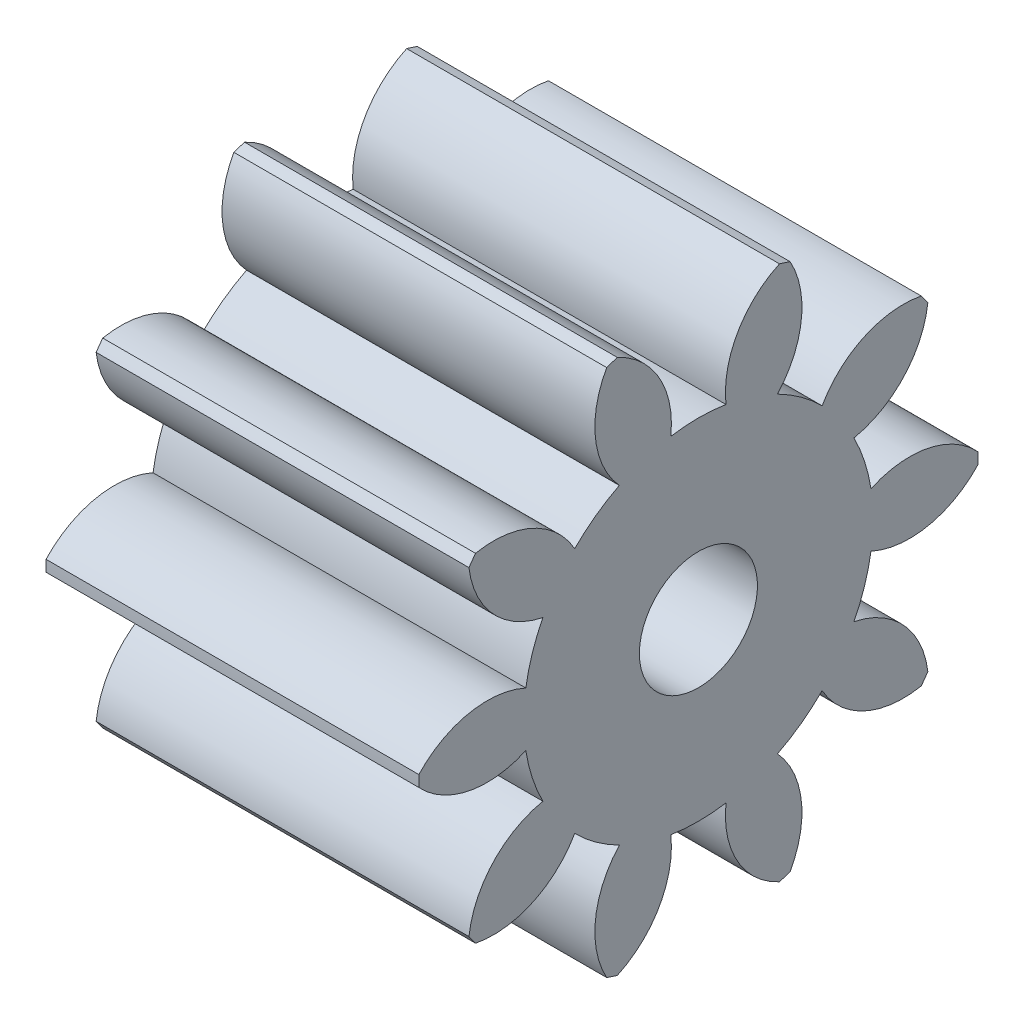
ISO-10303-21;
HEADER;
FILE_DESCRIPTION(('STEP AP214'),'2;1');
FILE_NAME('part.step','',(''),(''),'','','');
FILE_SCHEMA(('AUTOMOTIVE_DESIGN { 1 0 10303 214 1 1 1 1 }'));
ENDSEC;
DATA;
#1=APPLICATION_CONTEXT('core data for automotive mechanical design processes');
#2=APPLICATION_PROTOCOL_DEFINITION('international standard','automotive_design',2000,#1);
#3=PRODUCT_CONTEXT('',#1,'mechanical');
#4=PRODUCT('Part','Part','',(#3));
#5=PRODUCT_RELATED_PRODUCT_CATEGORY('part','',(#4));
#6=PRODUCT_DEFINITION_FORMATION('','',#4);
#7=PRODUCT_DEFINITION_CONTEXT('part definition',#1,'design');
#8=PRODUCT_DEFINITION('design','',#6,#7);
#9=PRODUCT_DEFINITION_SHAPE('','',#8);
#10=(LENGTH_UNIT() NAMED_UNIT(*) SI_UNIT(.MILLI.,.METRE.));
#11=(NAMED_UNIT(*) PLANE_ANGLE_UNIT() SI_UNIT($,.RADIAN.));
#12=(NAMED_UNIT(*) SI_UNIT($,.STERADIAN.) SOLID_ANGLE_UNIT());
#13=UNCERTAINTY_MEASURE_WITH_UNIT(LENGTH_MEASURE(1.E-05),#10,'distance_accuracy_value','');
#14=(GEOMETRIC_REPRESENTATION_CONTEXT(3) GLOBAL_UNCERTAINTY_ASSIGNED_CONTEXT((#13)) GLOBAL_UNIT_ASSIGNED_CONTEXT((#10,
#11,#12)) REPRESENTATION_CONTEXT('',''));
#15=CARTESIAN_POINT('',(0.,0.,0.));
#16=DIRECTION('',(0.,0.,1.));
#17=DIRECTION('',(1.,0.,0.));
#18=AXIS2_PLACEMENT_3D('',#15,#16,#17);
#19=CARTESIAN_POINT('',(-0.0287284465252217,1.05062918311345,0.));
#20=DIRECTION('',(-1.,0.,0.));
#21=DIRECTION('',(0.,0.,1.));
#22=AXIS2_PLACEMENT_3D('',#19,#20,#21);
#23=PLANE('',#22);
#24=CARTESIAN_POINT('',(-0.0287284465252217,1.05062918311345,0.));
#25=DIRECTION('',(-1.,0.,0.));
#26=DIRECTION('',(0.,0.,1.));
#27=AXIS2_PLACEMENT_3D('',#24,#25,#26);
#28=CIRCLE('',#27,0.95);
#29=CARTESIAN_POINT('',(-0.0287284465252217,1.05062918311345,0.95));
#30=VERTEX_POINT('',#29);
#31=EDGE_CURVE('E742',#30,#30,#28,.T.);
#32=ORIENTED_EDGE('',*,*,#31,.T.);
#33=EDGE_LOOP('',(#32));
#34=FACE_BOUND('',#33,.T.);
#35=CARTESIAN_POINT('',(-0.0287284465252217,0.121111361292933,-3.39904348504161));
#36=DIRECTION('',(-1.,0.,0.));
#37=DIRECTION('',(0.,-0.95105651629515,-0.309016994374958));
#38=AXIS2_PLACEMENT_3D('',#35,#36,#37);
#39=CIRCLE('',#38,1.5);
#40=CARTESIAN_POINT('',(-0.0287284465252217,1.48629734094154,-2.77753946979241));
#41=VERTEX_POINT('',#40);
#42=CARTESIAN_POINT('',(-0.0287284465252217,1.14085937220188,-4.49909529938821));
#43=VERTEX_POINT('',#42);
#44=EDGE_CURVE('E356',#41,#43,#39,.T.);
#45=ORIENTED_EDGE('',*,*,#44,.F.);
#46=CARTESIAN_POINT('',(-0.0287284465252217,1.05062918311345,0.));
#47=DIRECTION('',(-1.,0.,0.));
#48=DIRECTION('',(0.,-0.95105651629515,-0.309016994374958));
#49=AXIS2_PLACEMENT_3D('',#46,#47,#48);
#50=CIRCLE('',#49,2.8115);
#51=CARTESIAN_POINT('',(-0.0287284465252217,2.33076297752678,-2.50315595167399));
#52=VERTEX_POINT('',#51);
#53=EDGE_CURVE('E361',#52,#41,#50,.T.);
#54=ORIENTED_EDGE('',*,*,#53,.F.);
#55=CARTESIAN_POINT('',(-0.0287284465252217,3.80053252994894,-2.20352707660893));
#56=DIRECTION('',(-1.,0.,0.));
#57=DIRECTION('',(0.,-0.95105651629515,-0.309016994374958));
#58=AXIS2_PLACEMENT_3D('',#55,#56,#57);
#59=CIRCLE('',#58,1.5);
#60=CARTESIAN_POINT('',(-0.0287284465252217,3.6221332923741,-3.69288053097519));
#61=VERTEX_POINT('',#60);
#62=EDGE_CURVE('E358',#61,#52,#59,.T.);
#63=ORIENTED_EDGE('',*,*,#62,.F.);
#64=CARTESIAN_POINT('',(-0.0287284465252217,1.05062918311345,0.));
#65=DIRECTION('',(-1.,0.,0.));
#66=DIRECTION('',(0.,0.,1.));
#67=AXIS2_PLACEMENT_3D('',#64,#65,#66);
#68=CIRCLE('',#67,4.5);
#69=CARTESIAN_POINT('',(-0.0287284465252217,3.76812880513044,-3.58680858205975));
#70=VERTEX_POINT('',#69);
#71=EDGE_CURVE('E522',#70,#61,#68,.T.);
#72=ORIENTED_EDGE('',*,*,#71,.F.);
#73=CARTESIAN_POINT('',(-0.0287284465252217,2.29654110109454,-3.29624081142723));
#74=DIRECTION('',(-1.,0.,0.));
#75=DIRECTION('',(0.,-0.587785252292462,-0.809016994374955));
#76=AXIS2_PLACEMENT_3D('',#73,#74,#75);
#77=CIRCLE('',#76,1.5);
#78=CARTESIAN_POINT('',(-0.0287284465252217,3.03568886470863,-1.99099731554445));
#79=VERTEX_POINT('',#78);
#80=EDGE_CURVE('E342',#79,#70,#77,.T.);
#81=ORIENTED_EDGE('',*,*,#80,.F.);
#82=CARTESIAN_POINT('',(-0.0287284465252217,1.05062918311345,0.));
#83=DIRECTION('',(-1.,0.,0.));
#84=DIRECTION('',(0.,-0.587785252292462,-0.809016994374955));
#85=AXIS2_PLACEMENT_3D('',#82,#83,#84);
#86=CIRCLE('',#85,2.8115);
#87=CARTESIAN_POINT('',(-0.0287284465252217,3.55759733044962,-1.27265193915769));
#88=VERTEX_POINT('',#87);
#89=EDGE_CURVE('E347',#88,#79,#86,.T.);
#90=ORIENTED_EDGE('',*,*,#89,.F.);
#91=CARTESIAN_POINT('',(-0.0287284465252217,4.57054844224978,-0.166338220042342));
#92=DIRECTION('',(-1.,0.,0.));
#93=DIRECTION('',(0.,-0.587785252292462,-0.809016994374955));
#94=AXIS2_PLACEMENT_3D('',#91,#92,#93);
#95=CIRCLE('',#94,1.5);
#96=CARTESIAN_POINT('',(-0.0287284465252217,5.30164042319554,-1.47611091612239));
#97=VERTEX_POINT('',#96);
#98=EDGE_CURVE('E344',#97,#88,#95,.T.);
#99=ORIENTED_EDGE('',*,*,#98,.F.);
#100=CARTESIAN_POINT('',(-0.0287284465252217,5.35740574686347,-1.30448289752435));
#101=VERTEX_POINT('',#100);
#102=EDGE_CURVE('E518',#101,#97,#68,.T.);
#103=ORIENTED_EDGE('',*,*,#102,.F.);
#104=CARTESIAN_POINT('',(-0.0287284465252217,3.99607483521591,-1.93438618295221));
#105=DIRECTION('',(-1.,0.,0.));
#106=DIRECTION('',(0.,0.,-1.));
#107=AXIS2_PLACEMENT_3D('',#104,#105,#106);
#108=CIRCLE('',#107,1.5);
#109=CARTESIAN_POINT('',(-0.0287284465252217,3.8268550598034,-0.443961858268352));
#110=VERTEX_POINT('',#109);
#111=EDGE_CURVE('E490',#110,#101,#108,.T.);
#112=ORIENTED_EDGE('',*,*,#111,.F.);
#113=CARTESIAN_POINT('',(-0.0287284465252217,1.05062918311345,0.));
#114=DIRECTION('',(-1.,0.,0.));
#115=DIRECTION('',(0.,0.,-1.));
#116=AXIS2_PLACEMENT_3D('',#113,#114,#115);
#117=CIRCLE('',#116,2.8115);
#118=CARTESIAN_POINT('',(-0.0287284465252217,3.8268550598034,0.443961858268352));
#119=VERTEX_POINT('',#118);
#120=EDGE_CURVE('E495',#119,#110,#117,.T.);
#121=ORIENTED_EDGE('',*,*,#120,.F.);
#122=CARTESIAN_POINT('',(-0.0287284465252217,3.99607483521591,1.93438618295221));
#123=DIRECTION('',(-1.,0.,0.));
#124=DIRECTION('',(0.,0.,-1.));
#125=AXIS2_PLACEMENT_3D('',#122,#123,#124);
#126=CIRCLE('',#125,1.5);
#127=CARTESIAN_POINT('',(-0.0287284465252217,5.35740574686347,1.30448289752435));
#128=VERTEX_POINT('',#127);
#129=EDGE_CURVE('E492',#128,#119,#126,.T.);
#130=ORIENTED_EDGE('',*,*,#129,.F.);
#131=CARTESIAN_POINT('',(-0.0287284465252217,5.30164042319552,1.47611091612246));
#132=VERTEX_POINT('',#131);
#133=EDGE_CURVE('E515',#132,#128,#68,.T.);
#134=ORIENTED_EDGE('',*,*,#133,.F.);
#135=CARTESIAN_POINT('',(-0.0287284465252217,4.57054844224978,0.166338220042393));
#136=DIRECTION('',(-1.,0.,0.));
#137=DIRECTION('',(0.,0.587785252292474,-0.809016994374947));
#138=AXIS2_PLACEMENT_3D('',#135,#136,#137);
#139=CIRCLE('',#138,1.5);
#140=CARTESIAN_POINT('',(-0.0287284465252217,3.5575973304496,1.27265193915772));
#141=VERTEX_POINT('',#140);
#142=EDGE_CURVE('E468',#141,#132,#139,.T.);
#143=ORIENTED_EDGE('',*,*,#142,.F.);
#144=CARTESIAN_POINT('',(-0.0287284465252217,1.05062918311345,0.));
#145=DIRECTION('',(-1.,0.,0.));
#146=DIRECTION('',(0.,0.587785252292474,-0.809016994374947));
#147=AXIS2_PLACEMENT_3D('',#144,#145,#146);
#148=CIRCLE('',#147,2.8115);
#149=CARTESIAN_POINT('',(-0.0287284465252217,3.03568886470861,1.99099731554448));
#150=VERTEX_POINT('',#149);
#151=EDGE_CURVE('E473',#150,#141,#148,.T.);
#152=ORIENTED_EDGE('',*,*,#151,.F.);
#153=CARTESIAN_POINT('',(-0.0287284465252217,2.29654110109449,3.29624081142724));
#154=DIRECTION('',(-1.,0.,0.));
#155=DIRECTION('',(0.,0.587785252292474,-0.809016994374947));
#156=AXIS2_PLACEMENT_3D('',#153,#154,#155);
#157=CIRCLE('',#156,1.5);
#158=CARTESIAN_POINT('',(-0.0287284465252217,3.76812880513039,3.58680858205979));
#159=VERTEX_POINT('',#158);
#160=EDGE_CURVE('E470',#159,#150,#157,.T.);
#161=ORIENTED_EDGE('',*,*,#160,.F.);
#162=CARTESIAN_POINT('',(-0.0287284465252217,3.62213329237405,3.69288053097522));
#163=VERTEX_POINT('',#162);
#164=EDGE_CURVE('E523',#163,#159,#68,.T.);
#165=ORIENTED_EDGE('',*,*,#164,.F.);
#166=CARTESIAN_POINT('',(-0.0287284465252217,3.80053252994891,2.20352707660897));
#167=DIRECTION('',(-1.,0.,0.));
#168=DIRECTION('',(0.,0.951056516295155,-0.309016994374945));
#169=AXIS2_PLACEMENT_3D('',#166,#167,#168);
#170=CIRCLE('',#169,1.5);
#171=CARTESIAN_POINT('',(-0.0287284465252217,2.33076297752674,2.50315595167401));
#172=VERTEX_POINT('',#171);
#173=EDGE_CURVE('E403',#172,#163,#170,.T.);
#174=ORIENTED_EDGE('',*,*,#173,.F.);
#175=CARTESIAN_POINT('',(-0.0287284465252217,1.05062918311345,0.));
#176=DIRECTION('',(-1.,0.,0.));
#177=DIRECTION('',(0.,0.951056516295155,-0.309016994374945));
#178=AXIS2_PLACEMENT_3D('',#175,#176,#177);
#179=CIRCLE('',#178,2.8115);
#180=CARTESIAN_POINT('',(-0.0287284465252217,1.4862973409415,2.77753946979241));
#181=VERTEX_POINT('',#180);
#182=EDGE_CURVE('E408',#181,#172,#179,.T.);
#183=ORIENTED_EDGE('',*,*,#182,.F.);
#184=CARTESIAN_POINT('',(-0.0287284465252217,0.121111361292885,3.39904348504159));
#185=DIRECTION('',(-1.,0.,0.));
#186=DIRECTION('',(0.,0.951056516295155,-0.309016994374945));
#187=AXIS2_PLACEMENT_3D('',#184,#185,#186);
#188=CIRCLE('',#187,1.5);
#189=CARTESIAN_POINT('',(-0.0287284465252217,1.14085937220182,4.49909529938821));
#190=VERTEX_POINT('',#189);
#191=EDGE_CURVE('E405',#190,#181,#188,.T.);
#192=ORIENTED_EDGE('',*,*,#191,.F.);
#193=CARTESIAN_POINT('',(-0.0287284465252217,0.960398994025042,4.49909529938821));
#194=VERTEX_POINT('',#193);
#195=EDGE_CURVE('E686',#194,#190,#68,.T.);
#196=ORIENTED_EDGE('',*,*,#195,.F.);
#197=CARTESIAN_POINT('',(-0.0287284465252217,1.98014700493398,3.3990434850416));
#198=DIRECTION('',(-1.,0.,0.));
#199=DIRECTION('',(0.,0.951056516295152,0.309016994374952));
#200=AXIS2_PLACEMENT_3D('',#197,#198,#199);
#201=CIRCLE('',#200,1.5);
#202=CARTESIAN_POINT('',(-0.0287284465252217,0.614961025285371,2.77753946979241));
#203=VERTEX_POINT('',#202);
#204=EDGE_CURVE('E422',#203,#194,#201,.T.);
#205=ORIENTED_EDGE('',*,*,#204,.F.);
#206=CARTESIAN_POINT('',(-0.0287284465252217,1.05062918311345,0.));
#207=DIRECTION('',(-1.,0.,0.));
#208=DIRECTION('',(0.,0.951056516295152,0.309016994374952));
#209=AXIS2_PLACEMENT_3D('',#206,#207,#208);
#210=CIRCLE('',#209,2.8115);
#211=CARTESIAN_POINT('',(-0.0287284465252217,-0.229504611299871,2.503155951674));
#212=VERTEX_POINT('',#211);
#213=EDGE_CURVE('E427',#212,#203,#210,.T.);
#214=ORIENTED_EDGE('',*,*,#213,.F.);
#215=CARTESIAN_POINT('',(-0.0287284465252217,-1.69927416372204,2.20352707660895));
#216=DIRECTION('',(-1.,0.,0.));
#217=DIRECTION('',(0.,0.951056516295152,0.309016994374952));
#218=AXIS2_PLACEMENT_3D('',#215,#216,#217);
#219=CIRCLE('',#218,1.5);
#220=CARTESIAN_POINT('',(-0.0287284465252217,-1.52087492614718,3.69288053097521));
#221=VERTEX_POINT('',#220);
#222=EDGE_CURVE('E424',#221,#212,#219,.T.);
#223=ORIENTED_EDGE('',*,*,#222,.F.);
#224=CARTESIAN_POINT('',(-0.0287284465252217,-1.66687043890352,3.58680858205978));
#225=VERTEX_POINT('',#224);
#226=EDGE_CURVE('E667',#225,#221,#68,.T.);
#227=ORIENTED_EDGE('',*,*,#226,.F.);
#228=CARTESIAN_POINT('',(-0.0287284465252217,-0.195282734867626,3.29624081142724));
#229=DIRECTION('',(-1.,0.,0.));
#230=DIRECTION('',(0.,0.587785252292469,0.809016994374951));
#231=AXIS2_PLACEMENT_3D('',#228,#229,#230);
#232=CIRCLE('',#231,1.5);
#233=CARTESIAN_POINT('',(-0.0287284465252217,-0.934430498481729,1.99099731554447));
#234=VERTEX_POINT('',#233);
#235=EDGE_CURVE('E386',#234,#225,#232,.T.);
#236=ORIENTED_EDGE('',*,*,#235,.F.);
#237=CARTESIAN_POINT('',(-0.0287284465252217,1.05062918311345,0.));
#238=DIRECTION('',(-1.,0.,0.));
#239=DIRECTION('',(0.,0.587785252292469,0.809016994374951));
#240=AXIS2_PLACEMENT_3D('',#237,#238,#239);
#241=CIRCLE('',#240,2.8115);
#242=CARTESIAN_POINT('',(-0.0287284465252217,-1.45633896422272,1.27265193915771));
#243=VERTEX_POINT('',#242);
#244=EDGE_CURVE('E391',#243,#234,#241,.T.);
#245=ORIENTED_EDGE('',*,*,#244,.F.);
#246=CARTESIAN_POINT('',(-0.0287284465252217,-2.46929007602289,0.166338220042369));
#247=DIRECTION('',(-1.,0.,0.));
#248=DIRECTION('',(0.,0.587785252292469,0.809016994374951));
#249=AXIS2_PLACEMENT_3D('',#246,#247,#248);
#250=CIRCLE('',#249,1.5);
#251=CARTESIAN_POINT('',(-0.0287284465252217,-3.20038205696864,1.47611091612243));
#252=VERTEX_POINT('',#251);
#253=EDGE_CURVE('E388',#252,#243,#250,.T.);
#254=ORIENTED_EDGE('',*,*,#253,.F.);
#255=CARTESIAN_POINT('',(-0.0287284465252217,-3.25614738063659,1.30448289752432));
#256=VERTEX_POINT('',#255);
#257=EDGE_CURVE('E648',#256,#252,#68,.T.);
#258=ORIENTED_EDGE('',*,*,#257,.F.);
#259=CARTESIAN_POINT('',(-0.0287284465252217,-1.89481646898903,1.93438618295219));
#260=DIRECTION('',(-1.,0.,0.));
#261=DIRECTION('',(0.,0.,1.));
#262=AXIS2_PLACEMENT_3D('',#259,#260,#261);
#263=CIRCLE('',#262,1.5);
#264=CARTESIAN_POINT('',(-0.0287284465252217,-1.72559669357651,0.443961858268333));
#265=VERTEX_POINT('',#264);
#266=EDGE_CURVE('E369',#265,#256,#263,.T.);
#267=ORIENTED_EDGE('',*,*,#266,.F.);
#268=CARTESIAN_POINT('',(-0.0287284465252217,1.05062918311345,0.));
#269=DIRECTION('',(-1.,0.,0.));
#270=DIRECTION('',(0.,0.,1.));
#271=AXIS2_PLACEMENT_3D('',#268,#269,#270);
#272=CIRCLE('',#271,2.8115);
#273=CARTESIAN_POINT('',(-0.0287284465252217,-1.72559669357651,-0.443961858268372));
#274=VERTEX_POINT('',#273);
#275=EDGE_CURVE('E374',#274,#265,#272,.T.);
#276=ORIENTED_EDGE('',*,*,#275,.F.);
#277=CARTESIAN_POINT('',(-0.0287284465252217,-1.89481646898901,-1.93438618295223));
#278=DIRECTION('',(-1.,0.,0.));
#279=DIRECTION('',(0.,0.,1.));
#280=AXIS2_PLACEMENT_3D('',#277,#278,#279);
#281=CIRCLE('',#280,1.5);
#282=CARTESIAN_POINT('',(-0.0287284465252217,-3.25614738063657,-1.30448289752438));
#283=VERTEX_POINT('',#282);
#284=EDGE_CURVE('E371',#283,#274,#281,.T.);
#285=ORIENTED_EDGE('',*,*,#284,.F.);
#286=CARTESIAN_POINT('',(-0.0287284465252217,-3.20038205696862,-1.47611091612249));
#287=VERTEX_POINT('',#286);
#288=EDGE_CURVE('E629',#287,#283,#68,.T.);
#289=ORIENTED_EDGE('',*,*,#288,.F.);
#290=CARTESIAN_POINT('',(-0.0287284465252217,-2.46929007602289,-0.16633822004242));
#291=DIRECTION('',(-1.,0.,0.));
#292=DIRECTION('',(0.,-0.58778525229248,0.809016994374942));
#293=AXIS2_PLACEMENT_3D('',#290,#291,#292);
#294=CIRCLE('',#293,1.5);
#295=CARTESIAN_POINT('',(-0.0287284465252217,-1.4563389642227,-1.27265193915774));
#296=VERTEX_POINT('',#295);
#297=EDGE_CURVE('E325',#296,#287,#294,.T.);
#298=ORIENTED_EDGE('',*,*,#297,.F.);
#299=CARTESIAN_POINT('',(-0.0287284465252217,1.05062918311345,0.));
#300=DIRECTION('',(-1.,0.,0.));
#301=DIRECTION('',(0.,-0.58778525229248,0.809016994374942));
#302=AXIS2_PLACEMENT_3D('',#299,#300,#301);
#303=CIRCLE('',#302,2.8115);
#304=CARTESIAN_POINT('',(-0.0287284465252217,-0.9344304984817,-1.99099731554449));
#305=VERTEX_POINT('',#304);
#306=EDGE_CURVE('E330',#305,#296,#303,.T.);
#307=ORIENTED_EDGE('',*,*,#306,.F.);
#308=CARTESIAN_POINT('',(-0.0287284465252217,-0.195282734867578,-3.29624081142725));
#309=DIRECTION('',(-1.,0.,0.));
#310=DIRECTION('',(0.,-0.58778525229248,0.809016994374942));
#311=AXIS2_PLACEMENT_3D('',#308,#309,#310);
#312=CIRCLE('',#311,1.5);
#313=CARTESIAN_POINT('',(-0.0287284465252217,-1.66687043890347,-3.58680858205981));
#314=VERTEX_POINT('',#313);
#315=EDGE_CURVE('E327',#314,#305,#312,.T.);
#316=ORIENTED_EDGE('',*,*,#315,.F.);
#317=CARTESIAN_POINT('',(-0.0287284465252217,-1.52087492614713,-3.69288053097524));
#318=VERTEX_POINT('',#317);
#319=EDGE_CURVE('E610',#318,#314,#68,.T.);
#320=ORIENTED_EDGE('',*,*,#319,.F.);
#321=CARTESIAN_POINT('',(-0.0287284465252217,-1.69927416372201,-2.20352707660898));
#322=DIRECTION('',(-1.,0.,0.));
#323=DIRECTION('',(0.,-0.951056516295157,0.309016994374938));
#324=AXIS2_PLACEMENT_3D('',#321,#322,#323);
#325=CIRCLE('',#324,1.5);
#326=CARTESIAN_POINT('',(-0.0287284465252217,-0.229504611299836,-2.50315595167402));
#327=VERTEX_POINT('',#326);
#328=EDGE_CURVE('E301',#327,#318,#325,.T.);
#329=ORIENTED_EDGE('',*,*,#328,.F.);
#330=CARTESIAN_POINT('',(-0.0287284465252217,1.05062918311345,0.));
#331=DIRECTION('',(-1.,0.,0.));
#332=DIRECTION('',(0.,-0.951056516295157,0.309016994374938));
#333=AXIS2_PLACEMENT_3D('',#330,#331,#332);
#334=CIRCLE('',#333,2.8115);
#335=CARTESIAN_POINT('',(-0.0287284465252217,0.61496102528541,-2.77753946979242));
#336=VERTEX_POINT('',#335);
#337=EDGE_CURVE('E300',#336,#327,#334,.T.);
#338=ORIENTED_EDGE('',*,*,#337,.F.);
#339=CARTESIAN_POINT('',(-0.0287284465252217,1.98014700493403,-3.39904348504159));
#340=DIRECTION('',(-1.,0.,0.));
#341=DIRECTION('',(0.,-0.951056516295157,0.309016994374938));
#342=AXIS2_PLACEMENT_3D('',#339,#340,#341);
#343=CIRCLE('',#342,1.5);
#344=CARTESIAN_POINT('',(-0.0287284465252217,0.960398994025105,-4.49909529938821));
#345=VERTEX_POINT('',#344);
#346=EDGE_CURVE('E289',#345,#336,#343,.T.);
#347=ORIENTED_EDGE('',*,*,#346,.F.);
#348=EDGE_CURVE('E750',#43,#345,#68,.T.);
#349=ORIENTED_EDGE('',*,*,#348,.F.);
#350=EDGE_LOOP('',(#45,#54,#63,#72,#81,#90,#99,#103,#112,#121,#130,#134,#143,#152,#161,#165,
#174,#183,#192,#196,#205,#214,#223,#227,#236,#245,#254,#258,#267,#276,#285,#289,#298,#307,#316,
#320,#329,#338,#347,#349));
#351=FACE_BOUND('',#350,.T.);
#352=ADVANCED_FACE('F32',(#34,#351),#23,.F.);
#353=CARTESIAN_POINT('',(-16.0287284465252,1.05062918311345,0.));
#354=DIRECTION('',(-1.,0.,0.));
#355=DIRECTION('',(0.,0.,1.));
#356=AXIS2_PLACEMENT_3D('',#353,#354,#355);
#357=CYLINDRICAL_SURFACE('',#356,4.5);
#358=DIRECTION('',(-1.,0.,0.));
#359=VECTOR('',#358,1.);
#360=CARTESIAN_POINT('',(-3.02872844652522,1.14085937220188,-4.49909529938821));
#361=LINE('',#360,#359);
#362=CARTESIAN_POINT('',(-6.02872844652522,1.14085937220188,-4.49909529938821));
#363=VERTEX_POINT('',#362);
#364=EDGE_CURVE('E465',#43,#363,#361,.T.);
#365=ORIENTED_EDGE('',*,*,#364,.F.);
#366=ORIENTED_EDGE('',*,*,#348,.T.);
#367=DIRECTION('',(-1.,0.,0.));
#368=VECTOR('',#367,1.);
#369=CARTESIAN_POINT('',(-3.02872844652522,0.960398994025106,-4.49909529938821));
#370=LINE('',#369,#368);
#371=CARTESIAN_POINT('',(-6.02872844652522,0.960398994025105,-4.49909529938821));
#372=VERTEX_POINT('',#371);
#373=EDGE_CURVE('E295',#372,#345,#370,.F.);
#374=ORIENTED_EDGE('',*,*,#373,.F.);
#375=CARTESIAN_POINT('',(-6.02872844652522,1.05062918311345,0.));
#376=DIRECTION('',(-1.,0.,0.));
#377=DIRECTION('',(0.,0.,1.));
#378=AXIS2_PLACEMENT_3D('',#375,#376,#377);
#379=CIRCLE('',#378,4.5);
#380=EDGE_CURVE('E580',#363,#372,#379,.T.);
#381=ORIENTED_EDGE('',*,*,#380,.F.);
#382=EDGE_LOOP('',(#365,#366,#374,#381));
#383=FACE_BOUND('',#382,.T.);
#384=ADVANCED_FACE('F732',(#383),#357,.T.);
#385=DIRECTION('',(-1.,0.,0.));
#386=VECTOR('',#385,1.);
#387=CARTESIAN_POINT('',(-3.02872844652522,3.6221332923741,-3.69288053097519));
#388=LINE('',#387,#386);
#389=CARTESIAN_POINT('',(-6.02872844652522,3.6221332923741,-3.69288053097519));
#390=VERTEX_POINT('',#389);
#391=EDGE_CURVE('E463',#390,#61,#388,.F.);
#392=ORIENTED_EDGE('',*,*,#391,.F.);
#393=CARTESIAN_POINT('',(-6.02872844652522,3.76812880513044,-3.58680858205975));
#394=VERTEX_POINT('',#393);
#395=EDGE_CURVE('E516',#394,#390,#379,.T.);
#396=ORIENTED_EDGE('',*,*,#395,.F.);
#397=DIRECTION('',(-1.,0.,0.));
#398=VECTOR('',#397,1.);
#399=CARTESIAN_POINT('',(-3.02872844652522,3.76812880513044,-3.58680858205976));
#400=LINE('',#399,#398);
#401=EDGE_CURVE('E461',#70,#394,#400,.T.);
#402=ORIENTED_EDGE('',*,*,#401,.F.);
#403=ORIENTED_EDGE('',*,*,#71,.T.);
#404=EDGE_LOOP('',(#392,#396,#402,#403));
#405=FACE_BOUND('',#404,.T.);
#406=ADVANCED_FACE('F577',(#405),#357,.T.);
#407=DIRECTION('',(-1.,0.,0.));
#408=VECTOR('',#407,1.);
#409=CARTESIAN_POINT('',(-3.02872844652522,5.30164042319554,-1.47611091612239));
#410=LINE('',#409,#408);
#411=CARTESIAN_POINT('',(-6.02872844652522,5.30164042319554,-1.47611091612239));
#412=VERTEX_POINT('',#411);
#413=EDGE_CURVE('E459',#412,#97,#410,.F.);
#414=ORIENTED_EDGE('',*,*,#413,.F.);
#415=CARTESIAN_POINT('',(-6.02872844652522,5.35740574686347,-1.30448289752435));
#416=VERTEX_POINT('',#415);
#417=EDGE_CURVE('E512',#416,#412,#379,.T.);
#418=ORIENTED_EDGE('',*,*,#417,.F.);
#419=DIRECTION('',(-1.,0.,0.));
#420=VECTOR('',#419,1.);
#421=CARTESIAN_POINT('',(-3.02872844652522,5.35740574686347,-1.30448289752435));
#422=LINE('',#421,#420);
#423=EDGE_CURVE('E509',#101,#416,#422,.T.);
#424=ORIENTED_EDGE('',*,*,#423,.F.);
#425=ORIENTED_EDGE('',*,*,#102,.T.);
#426=EDGE_LOOP('',(#414,#418,#424,#425));
#427=FACE_BOUND('',#426,.T.);
#428=ADVANCED_FACE('F551',(#427),#357,.T.);
#429=DIRECTION('',(-1.,0.,0.));
#430=VECTOR('',#429,1.);
#431=CARTESIAN_POINT('',(-3.02872844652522,-3.20038205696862,-1.47611091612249));
#432=LINE('',#431,#430);
#433=CARTESIAN_POINT('',(-6.02872844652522,-3.20038205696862,-1.47611091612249));
#434=VERTEX_POINT('',#433);
#435=EDGE_CURVE('E457',#287,#434,#432,.T.);
#436=ORIENTED_EDGE('',*,*,#435,.F.);
#437=ORIENTED_EDGE('',*,*,#288,.T.);
#438=DIRECTION('',(-1.,0.,0.));
#439=VECTOR('',#438,1.);
#440=CARTESIAN_POINT('',(-3.02872844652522,-3.25614738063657,-1.30448289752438));
#441=LINE('',#440,#439);
#442=CARTESIAN_POINT('',(-6.02872844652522,-3.25614738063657,-1.30448289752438));
#443=VERTEX_POINT('',#442);
#444=EDGE_CURVE('E440',#443,#283,#441,.F.);
#445=ORIENTED_EDGE('',*,*,#444,.F.);
#446=EDGE_CURVE('E596',#434,#443,#379,.T.);
#447=ORIENTED_EDGE('',*,*,#446,.F.);
#448=EDGE_LOOP('',(#436,#437,#445,#447));
#449=FACE_BOUND('',#448,.T.);
#450=ADVANCED_FACE('F627',(#449),#357,.T.);
#451=DIRECTION('',(-1.,0.,0.));
#452=VECTOR('',#451,1.);
#453=CARTESIAN_POINT('',(-3.02872844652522,-1.66687043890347,-3.58680858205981));
#454=LINE('',#453,#452);
#455=CARTESIAN_POINT('',(-6.02872844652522,-1.66687043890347,-3.58680858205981));
#456=VERTEX_POINT('',#455);
#457=EDGE_CURVE('E455',#456,#314,#454,.F.);
#458=ORIENTED_EDGE('',*,*,#457,.F.);
#459=CARTESIAN_POINT('',(-6.02872844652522,-1.52087492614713,-3.69288053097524));
#460=VERTEX_POINT('',#459);
#461=EDGE_CURVE('E582',#460,#456,#379,.T.);
#462=ORIENTED_EDGE('',*,*,#461,.F.);
#463=DIRECTION('',(-1.,0.,0.));
#464=VECTOR('',#463,1.);
#465=CARTESIAN_POINT('',(-3.02872844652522,-1.52087492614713,-3.69288053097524));
#466=LINE('',#465,#464);
#467=EDGE_CURVE('E453',#318,#460,#466,.T.);
#468=ORIENTED_EDGE('',*,*,#467,.F.);
#469=ORIENTED_EDGE('',*,*,#319,.T.);
#470=EDGE_LOOP('',(#458,#462,#468,#469));
#471=FACE_BOUND('',#470,.T.);
#472=ADVANCED_FACE('F608',(#471),#357,.T.);
#473=DIRECTION('',(-1.,0.,0.));
#474=VECTOR('',#473,1.);
#475=CARTESIAN_POINT('',(-3.02872844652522,3.62213329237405,3.69288053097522));
#476=LINE('',#475,#474);
#477=CARTESIAN_POINT('',(-6.02872844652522,3.62213329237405,3.69288053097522));
#478=VERTEX_POINT('',#477);
#479=EDGE_CURVE('E450',#163,#478,#476,.T.);
#480=ORIENTED_EDGE('',*,*,#479,.F.);
#481=ORIENTED_EDGE('',*,*,#164,.T.);
#482=DIRECTION('',(-1.,0.,0.));
#483=VECTOR('',#482,1.);
#484=CARTESIAN_POINT('',(-3.02872844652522,3.76812880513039,3.58680858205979));
#485=LINE('',#484,#483);
#486=CARTESIAN_POINT('',(-6.02872844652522,3.76812880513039,3.58680858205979));
#487=VERTEX_POINT('',#486);
#488=EDGE_CURVE('E484',#487,#159,#485,.F.);
#489=ORIENTED_EDGE('',*,*,#488,.F.);
#490=EDGE_CURVE('E517',#478,#487,#379,.T.);
#491=ORIENTED_EDGE('',*,*,#490,.F.);
#492=EDGE_LOOP('',(#480,#481,#489,#491));
#493=FACE_BOUND('',#492,.T.);
#494=ADVANCED_FACE('F703',(#493),#357,.T.);
#495=DIRECTION('',(-1.,0.,0.));
#496=VECTOR('',#495,1.);
#497=CARTESIAN_POINT('',(-3.02872844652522,1.14085937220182,4.49909529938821));
#498=LINE('',#497,#496);
#499=CARTESIAN_POINT('',(-6.02872844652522,1.14085937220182,4.49909529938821));
#500=VERTEX_POINT('',#499);
#501=EDGE_CURVE('E448',#500,#190,#498,.F.);
#502=ORIENTED_EDGE('',*,*,#501,.F.);
#503=CARTESIAN_POINT('',(-6.02872844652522,0.960398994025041,4.49909529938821));
#504=VERTEX_POINT('',#503);
#505=EDGE_CURVE('E584',#504,#500,#379,.T.);
#506=ORIENTED_EDGE('',*,*,#505,.F.);
#507=DIRECTION('',(-1.,0.,0.));
#508=VECTOR('',#507,1.);
#509=CARTESIAN_POINT('',(-3.02872844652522,0.960398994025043,4.49909529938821));
#510=LINE('',#509,#508);
#511=EDGE_CURVE('E446',#194,#504,#510,.T.);
#512=ORIENTED_EDGE('',*,*,#511,.F.);
#513=ORIENTED_EDGE('',*,*,#195,.T.);
#514=EDGE_LOOP('',(#502,#506,#512,#513));
#515=FACE_BOUND('',#514,.T.);
#516=ADVANCED_FACE('F684',(#515),#357,.T.);
#517=DIRECTION('',(-1.,0.,0.));
#518=VECTOR('',#517,1.);
#519=CARTESIAN_POINT('',(-3.02872844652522,-1.52087492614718,3.69288053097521));
#520=LINE('',#519,#518);
#521=CARTESIAN_POINT('',(-6.02872844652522,-1.52087492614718,3.69288053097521));
#522=VERTEX_POINT('',#521);
#523=EDGE_CURVE('E444',#522,#221,#520,.F.);
#524=ORIENTED_EDGE('',*,*,#523,.F.);
#525=CARTESIAN_POINT('',(-6.02872844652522,-1.66687043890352,3.58680858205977));
#526=VERTEX_POINT('',#525);
#527=EDGE_CURVE('E588',#526,#522,#379,.T.);
#528=ORIENTED_EDGE('',*,*,#527,.F.);
#529=DIRECTION('',(-1.,0.,0.));
#530=VECTOR('',#529,1.);
#531=CARTESIAN_POINT('',(-3.02872844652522,-1.66687043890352,3.58680858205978));
#532=LINE('',#531,#530);
#533=EDGE_CURVE('E438',#225,#526,#532,.T.);
#534=ORIENTED_EDGE('',*,*,#533,.F.);
#535=ORIENTED_EDGE('',*,*,#226,.T.);
#536=EDGE_LOOP('',(#524,#528,#534,#535));
#537=FACE_BOUND('',#536,.T.);
#538=ADVANCED_FACE('F665',(#537),#357,.T.);
#539=DIRECTION('',(-1.,0.,0.));
#540=VECTOR('',#539,1.);
#541=CARTESIAN_POINT('',(-3.02872844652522,-3.25614738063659,1.30448289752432));
#542=LINE('',#541,#540);
#543=CARTESIAN_POINT('',(-6.02872844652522,-3.25614738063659,1.30448289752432));
#544=VERTEX_POINT('',#543);
#545=EDGE_CURVE('E442',#256,#544,#542,.T.);
#546=ORIENTED_EDGE('',*,*,#545,.F.);
#547=ORIENTED_EDGE('',*,*,#257,.T.);
#548=DIRECTION('',(-1.,0.,0.));
#549=VECTOR('',#548,1.);
#550=CARTESIAN_POINT('',(-3.02872844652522,-3.20038205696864,1.47611091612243));
#551=LINE('',#550,#549);
#552=CARTESIAN_POINT('',(-6.02872844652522,-3.20038205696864,1.47611091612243));
#553=VERTEX_POINT('',#552);
#554=EDGE_CURVE('E421',#553,#252,#551,.F.);
#555=ORIENTED_EDGE('',*,*,#554,.F.);
#556=EDGE_CURVE('E592',#544,#553,#379,.T.);
#557=ORIENTED_EDGE('',*,*,#556,.F.);
#558=EDGE_LOOP('',(#546,#547,#555,#557));
#559=FACE_BOUND('',#558,.T.);
#560=ADVANCED_FACE('F646',(#559),#357,.T.);
#561=CARTESIAN_POINT('',(-6.02872844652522,1.05062918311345,0.));
#562=DIRECTION('',(1.,0.,0.));
#563=DIRECTION('',(0.,0.,-1.));
#564=AXIS2_PLACEMENT_3D('',#561,#562,#563);
#565=PLANE('',#564);
#566=CARTESIAN_POINT('',(-6.02872844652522,1.05062918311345,0.));
#567=DIRECTION('',(1.,0.,0.));
#568=DIRECTION('',(0.,0.,-1.));
#569=AXIS2_PLACEMENT_3D('',#566,#567,#568);
#570=CIRCLE('',#569,0.95);
#571=CARTESIAN_POINT('',(-6.02872844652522,1.05062918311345,-0.95));
#572=VERTEX_POINT('',#571);
#573=EDGE_CURVE('E35',#572,#572,#570,.T.);
#574=ORIENTED_EDGE('',*,*,#573,.T.);
#575=EDGE_LOOP('',(#574));
#576=FACE_BOUND('',#575,.T.);
#577=CARTESIAN_POINT('',(-6.02872844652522,0.121111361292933,-3.39904348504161));
#578=DIRECTION('',(-1.,0.,0.));
#579=DIRECTION('',(0.,-0.95105651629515,-0.309016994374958));
#580=AXIS2_PLACEMENT_3D('',#577,#578,#579);
#581=CIRCLE('',#580,1.5);
#582=CARTESIAN_POINT('',(-6.02872844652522,1.48629734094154,-2.77753946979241));
#583=VERTEX_POINT('',#582);
#584=EDGE_CURVE('E47',#583,#363,#581,.T.);
#585=ORIENTED_EDGE('',*,*,#584,.T.);
#586=ORIENTED_EDGE('',*,*,#380,.T.);
#587=CARTESIAN_POINT('',(-6.02872844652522,1.98014700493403,-3.39904348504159));
#588=DIRECTION('',(1.,0.,0.));
#589=DIRECTION('',(0.,0.,-1.));
#590=AXIS2_PLACEMENT_3D('',#587,#588,#589);
#591=CIRCLE('',#590,1.5);
#592=CARTESIAN_POINT('',(-6.02872844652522,0.61496102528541,-2.77753946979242));
#593=VERTEX_POINT('',#592);
#594=EDGE_CURVE('E537',#593,#372,#591,.T.);
#595=ORIENTED_EDGE('',*,*,#594,.F.);
#596=CARTESIAN_POINT('',(-6.02872844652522,1.05062918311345,0.));
#597=DIRECTION('',(-1.,0.,0.));
#598=DIRECTION('',(0.,-0.951056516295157,0.309016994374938));
#599=AXIS2_PLACEMENT_3D('',#596,#597,#598);
#600=CIRCLE('',#599,2.8115);
#601=CARTESIAN_POINT('',(-6.02872844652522,-0.229504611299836,-2.50315595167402));
#602=VERTEX_POINT('',#601);
#603=EDGE_CURVE('E308',#593,#602,#600,.T.);
#604=ORIENTED_EDGE('',*,*,#603,.T.);
#605=CARTESIAN_POINT('',(-6.02872844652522,-1.69927416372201,-2.20352707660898));
#606=DIRECTION('',(-1.,0.,0.));
#607=DIRECTION('',(0.,-0.951056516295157,0.309016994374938));
#608=AXIS2_PLACEMENT_3D('',#605,#606,#607);
#609=CIRCLE('',#608,1.5);
#610=EDGE_CURVE('E320',#602,#460,#609,.T.);
#611=ORIENTED_EDGE('',*,*,#610,.T.);
#612=ORIENTED_EDGE('',*,*,#461,.T.);
#613=CARTESIAN_POINT('',(-6.02872844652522,-0.195282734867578,-3.29624081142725));
#614=DIRECTION('',(1.,0.,0.));
#615=DIRECTION('',(0.,0.,-1.));
#616=AXIS2_PLACEMENT_3D('',#613,#614,#615);
#617=CIRCLE('',#616,1.5);
#618=CARTESIAN_POINT('',(-6.02872844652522,-0.9344304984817,-1.99099731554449));
#619=VERTEX_POINT('',#618);
#620=EDGE_CURVE('E539',#619,#456,#617,.T.);
#621=ORIENTED_EDGE('',*,*,#620,.F.);
#622=CARTESIAN_POINT('',(-6.02872844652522,1.05062918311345,0.));
#623=DIRECTION('',(-1.,0.,0.));
#624=DIRECTION('',(0.,-0.58778525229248,0.809016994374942));
#625=AXIS2_PLACEMENT_3D('',#622,#623,#624);
#626=CIRCLE('',#625,2.8115);
#627=CARTESIAN_POINT('',(-6.02872844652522,-1.4563389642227,-1.27265193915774));
#628=VERTEX_POINT('',#627);
#629=EDGE_CURVE('E328',#619,#628,#626,.T.);
#630=ORIENTED_EDGE('',*,*,#629,.T.);
#631=CARTESIAN_POINT('',(-6.02872844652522,-2.46929007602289,-0.16633822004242));
#632=DIRECTION('',(-1.,0.,0.));
#633=DIRECTION('',(0.,-0.58778525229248,0.809016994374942));
#634=AXIS2_PLACEMENT_3D('',#631,#632,#633);
#635=CIRCLE('',#634,1.5);
#636=EDGE_CURVE('E310',#628,#434,#635,.T.);
#637=ORIENTED_EDGE('',*,*,#636,.T.);
#638=ORIENTED_EDGE('',*,*,#446,.T.);
#639=CARTESIAN_POINT('',(-6.02872844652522,-1.89481646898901,-1.93438618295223));
#640=DIRECTION('',(1.,0.,0.));
#641=DIRECTION('',(0.,0.,-1.));
#642=AXIS2_PLACEMENT_3D('',#639,#640,#641);
#643=CIRCLE('',#642,1.5);
#644=CARTESIAN_POINT('',(-6.02872844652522,-1.72559669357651,-0.443961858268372));
#645=VERTEX_POINT('',#644);
#646=EDGE_CURVE('E531',#645,#443,#643,.T.);
#647=ORIENTED_EDGE('',*,*,#646,.F.);
#648=CARTESIAN_POINT('',(-6.02872844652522,1.05062918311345,0.));
#649=DIRECTION('',(-1.,0.,0.));
#650=DIRECTION('',(0.,0.,1.));
#651=AXIS2_PLACEMENT_3D('',#648,#649,#650);
#652=CIRCLE('',#651,2.8115);
#653=CARTESIAN_POINT('',(-6.02872844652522,-1.72559669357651,0.443961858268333));
#654=VERTEX_POINT('',#653);
#655=EDGE_CURVE('E372',#645,#654,#652,.T.);
#656=ORIENTED_EDGE('',*,*,#655,.T.);
#657=CARTESIAN_POINT('',(-6.02872844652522,-1.89481646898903,1.93438618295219));
#658=DIRECTION('',(-1.,0.,0.));
#659=DIRECTION('',(0.,0.,1.));
#660=AXIS2_PLACEMENT_3D('',#657,#658,#659);
#661=CIRCLE('',#660,1.5);
#662=EDGE_CURVE('E341',#654,#544,#661,.T.);
#663=ORIENTED_EDGE('',*,*,#662,.T.);
#664=ORIENTED_EDGE('',*,*,#556,.T.);
#665=CARTESIAN_POINT('',(-6.02872844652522,-2.46929007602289,0.166338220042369));
#666=DIRECTION('',(1.,0.,0.));
#667=DIRECTION('',(0.,0.,-1.));
#668=AXIS2_PLACEMENT_3D('',#665,#666,#667);
#669=CIRCLE('',#668,1.5);
#670=CARTESIAN_POINT('',(-6.02872844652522,-1.45633896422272,1.27265193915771));
#671=VERTEX_POINT('',#670);
#672=EDGE_CURVE('E529',#671,#553,#669,.T.);
#673=ORIENTED_EDGE('',*,*,#672,.F.);
#674=CARTESIAN_POINT('',(-6.02872844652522,1.05062918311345,0.));
#675=DIRECTION('',(-1.,0.,0.));
#676=DIRECTION('',(0.,0.587785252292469,0.809016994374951));
#677=AXIS2_PLACEMENT_3D('',#674,#675,#676);
#678=CIRCLE('',#677,2.8115);
#679=CARTESIAN_POINT('',(-6.02872844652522,-0.934430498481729,1.99099731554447));
#680=VERTEX_POINT('',#679);
#681=EDGE_CURVE('E389',#671,#680,#678,.T.);
#682=ORIENTED_EDGE('',*,*,#681,.T.);
#683=CARTESIAN_POINT('',(-6.02872844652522,-0.195282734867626,3.29624081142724));
#684=DIRECTION('',(-1.,0.,0.));
#685=DIRECTION('',(0.,0.587785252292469,0.809016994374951));
#686=AXIS2_PLACEMENT_3D('',#683,#684,#685);
#687=CIRCLE('',#686,1.5);
#688=EDGE_CURVE('E385',#680,#526,#687,.T.);
#689=ORIENTED_EDGE('',*,*,#688,.T.);
#690=ORIENTED_EDGE('',*,*,#527,.T.);
#691=CARTESIAN_POINT('',(-6.02872844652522,-1.69927416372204,2.20352707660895));
#692=DIRECTION('',(1.,0.,0.));
#693=DIRECTION('',(0.,0.,-1.));
#694=AXIS2_PLACEMENT_3D('',#691,#692,#693);
#695=CIRCLE('',#694,1.5);
#696=CARTESIAN_POINT('',(-6.02872844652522,-0.229504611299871,2.503155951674));
#697=VERTEX_POINT('',#696);
#698=EDGE_CURVE('E533',#697,#522,#695,.T.);
#699=ORIENTED_EDGE('',*,*,#698,.F.);
#700=CARTESIAN_POINT('',(-6.02872844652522,1.05062918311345,0.));
#701=DIRECTION('',(-1.,0.,0.));
#702=DIRECTION('',(0.,0.951056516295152,0.309016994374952));
#703=AXIS2_PLACEMENT_3D('',#700,#701,#702);
#704=CIRCLE('',#703,2.8115);
#705=CARTESIAN_POINT('',(-6.02872844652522,0.614961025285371,2.77753946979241));
#706=VERTEX_POINT('',#705);
#707=EDGE_CURVE('E425',#697,#706,#704,.T.);
#708=ORIENTED_EDGE('',*,*,#707,.T.);
#709=CARTESIAN_POINT('',(-6.02872844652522,1.98014700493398,3.3990434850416));
#710=DIRECTION('',(-1.,0.,0.));
#711=DIRECTION('',(0.,0.951056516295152,0.309016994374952));
#712=AXIS2_PLACEMENT_3D('',#709,#710,#711);
#713=CIRCLE('',#712,1.5);
#714=EDGE_CURVE('E402',#706,#504,#713,.T.);
#715=ORIENTED_EDGE('',*,*,#714,.T.);
#716=ORIENTED_EDGE('',*,*,#505,.T.);
#717=CARTESIAN_POINT('',(-6.02872844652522,0.121111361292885,3.39904348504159));
#718=DIRECTION('',(1.,0.,0.));
#719=DIRECTION('',(0.,0.,-1.));
#720=AXIS2_PLACEMENT_3D('',#717,#718,#719);
#721=CIRCLE('',#720,1.5);
#722=CARTESIAN_POINT('',(-6.02872844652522,1.4862973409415,2.77753946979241));
#723=VERTEX_POINT('',#722);
#724=EDGE_CURVE('E535',#723,#500,#721,.T.);
#725=ORIENTED_EDGE('',*,*,#724,.F.);
#726=CARTESIAN_POINT('',(-6.02872844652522,1.05062918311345,0.));
#727=DIRECTION('',(-1.,0.,0.));
#728=DIRECTION('',(0.,0.951056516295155,-0.309016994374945));
#729=AXIS2_PLACEMENT_3D('',#726,#727,#728);
#730=CIRCLE('',#729,2.8115);
#731=CARTESIAN_POINT('',(-6.02872844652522,2.33076297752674,2.50315595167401));
#732=VERTEX_POINT('',#731);
#733=EDGE_CURVE('E406',#723,#732,#730,.T.);
#734=ORIENTED_EDGE('',*,*,#733,.T.);
#735=CARTESIAN_POINT('',(-6.02872844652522,3.80053252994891,2.20352707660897));
#736=DIRECTION('',(-1.,0.,0.));
#737=DIRECTION('',(0.,0.951056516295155,-0.309016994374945));
#738=AXIS2_PLACEMENT_3D('',#735,#736,#737);
#739=CIRCLE('',#738,1.5);
#740=EDGE_CURVE('E411',#732,#478,#739,.T.);
#741=ORIENTED_EDGE('',*,*,#740,.T.);
#742=ORIENTED_EDGE('',*,*,#490,.T.);
#743=CARTESIAN_POINT('',(-6.02872844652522,2.29654110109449,3.29624081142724));
#744=DIRECTION('',(1.,0.,0.));
#745=DIRECTION('',(0.,0.,-1.));
#746=AXIS2_PLACEMENT_3D('',#743,#744,#745);
#747=CIRCLE('',#746,1.5);
#748=CARTESIAN_POINT('',(-6.02872844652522,3.03568886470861,1.99099731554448));
#749=VERTEX_POINT('',#748);
#750=EDGE_CURVE('E526',#749,#487,#747,.T.);
#751=ORIENTED_EDGE('',*,*,#750,.F.);
#752=CARTESIAN_POINT('',(-6.02872844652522,1.05062918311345,0.));
#753=DIRECTION('',(-1.,0.,0.));
#754=DIRECTION('',(0.,0.587785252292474,-0.809016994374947));
#755=AXIS2_PLACEMENT_3D('',#752,#753,#754);
#756=CIRCLE('',#755,2.8115);
#757=CARTESIAN_POINT('',(-6.02872844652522,3.5575973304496,1.27265193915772));
#758=VERTEX_POINT('',#757);
#759=EDGE_CURVE('E471',#749,#758,#756,.T.);
#760=ORIENTED_EDGE('',*,*,#759,.T.);
#761=CARTESIAN_POINT('',(-6.02872844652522,4.57054844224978,0.166338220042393));
#762=DIRECTION('',(-1.,0.,0.));
#763=DIRECTION('',(0.,0.587785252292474,-0.809016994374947));
#764=AXIS2_PLACEMENT_3D('',#761,#762,#763);
#765=CIRCLE('',#764,1.5);
#766=CARTESIAN_POINT('',(-6.02872844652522,5.30164042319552,1.47611091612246));
#767=VERTEX_POINT('',#766);
#768=EDGE_CURVE('E467',#758,#767,#765,.T.);
#769=ORIENTED_EDGE('',*,*,#768,.T.);
#770=CARTESIAN_POINT('',(-6.02872844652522,5.35740574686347,1.30448289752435));
#771=VERTEX_POINT('',#770);
#772=EDGE_CURVE('E511',#767,#771,#379,.T.);
#773=ORIENTED_EDGE('',*,*,#772,.T.);
#774=CARTESIAN_POINT('',(-6.02872844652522,3.99607483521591,1.93438618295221));
#775=DIRECTION('',(1.,0.,0.));
#776=DIRECTION('',(0.,0.,-1.));
#777=AXIS2_PLACEMENT_3D('',#774,#775,#776);
#778=CIRCLE('',#777,1.5);
#779=CARTESIAN_POINT('',(-6.02872844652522,3.8268550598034,0.443961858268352));
#780=VERTEX_POINT('',#779);
#781=EDGE_CURVE('E521',#780,#771,#778,.T.);
#782=ORIENTED_EDGE('',*,*,#781,.F.);
#783=CARTESIAN_POINT('',(-6.02872844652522,1.05062918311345,0.));
#784=DIRECTION('',(-1.,0.,0.));
#785=DIRECTION('',(0.,0.,-1.));
#786=AXIS2_PLACEMENT_3D('',#783,#784,#785);
#787=CIRCLE('',#786,2.8115);
#788=CARTESIAN_POINT('',(-6.02872844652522,3.8268550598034,-0.443961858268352));
#789=VERTEX_POINT('',#788);
#790=EDGE_CURVE('E493',#780,#789,#787,.T.);
#791=ORIENTED_EDGE('',*,*,#790,.T.);
#792=CARTESIAN_POINT('',(-6.02872844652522,3.99607483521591,-1.93438618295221));
#793=DIRECTION('',(-1.,0.,0.));
#794=DIRECTION('',(0.,0.,-1.));
#795=AXIS2_PLACEMENT_3D('',#792,#793,#794);
#796=CIRCLE('',#795,1.5);
#797=EDGE_CURVE('E489',#789,#416,#796,.T.);
#798=ORIENTED_EDGE('',*,*,#797,.T.);
#799=ORIENTED_EDGE('',*,*,#417,.T.);
#800=CARTESIAN_POINT('',(-6.02872844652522,4.57054844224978,-0.166338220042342));
#801=DIRECTION('',(1.,0.,0.));
#802=DIRECTION('',(0.,0.,-1.));
#803=AXIS2_PLACEMENT_3D('',#800,#801,#802);
#804=CIRCLE('',#803,1.5);
#805=CARTESIAN_POINT('',(-6.02872844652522,3.55759733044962,-1.27265193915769));
#806=VERTEX_POINT('',#805);
#807=EDGE_CURVE('E40',#806,#412,#804,.T.);
#808=ORIENTED_EDGE('',*,*,#807,.F.);
#809=CARTESIAN_POINT('',(-6.02872844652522,1.05062918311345,0.));
#810=DIRECTION('',(-1.,0.,0.));
#811=DIRECTION('',(0.,-0.587785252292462,-0.809016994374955));
#812=AXIS2_PLACEMENT_3D('',#809,#810,#811);
#813=CIRCLE('',#812,2.8115);
#814=CARTESIAN_POINT('',(-6.02872844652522,3.03568886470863,-1.99099731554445));
#815=VERTEX_POINT('',#814);
#816=EDGE_CURVE('E345',#806,#815,#813,.T.);
#817=ORIENTED_EDGE('',*,*,#816,.T.);
#818=CARTESIAN_POINT('',(-6.02872844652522,2.29654110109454,-3.29624081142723));
#819=DIRECTION('',(-1.,0.,0.));
#820=DIRECTION('',(0.,-0.587785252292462,-0.809016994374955));
#821=AXIS2_PLACEMENT_3D('',#818,#819,#820);
#822=CIRCLE('',#821,1.5);
#823=EDGE_CURVE('E55',#815,#394,#822,.T.);
#824=ORIENTED_EDGE('',*,*,#823,.T.);
#825=ORIENTED_EDGE('',*,*,#395,.T.);
#826=CARTESIAN_POINT('',(-6.02872844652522,3.80053252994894,-2.20352707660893));
#827=DIRECTION('',(1.,0.,0.));
#828=DIRECTION('',(0.,0.,-1.));
#829=AXIS2_PLACEMENT_3D('',#826,#827,#828);
#830=CIRCLE('',#829,1.5);
#831=CARTESIAN_POINT('',(-6.02872844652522,2.33076297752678,-2.50315595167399));
#832=VERTEX_POINT('',#831);
#833=EDGE_CURVE('E11',#832,#390,#830,.T.);
#834=ORIENTED_EDGE('',*,*,#833,.F.);
#835=CARTESIAN_POINT('',(-6.02872844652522,1.05062918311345,0.));
#836=DIRECTION('',(-1.,0.,0.));
#837=DIRECTION('',(0.,-0.95105651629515,-0.309016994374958));
#838=AXIS2_PLACEMENT_3D('',#835,#836,#837);
#839=CIRCLE('',#838,2.8115);
#840=EDGE_CURVE('E359',#832,#583,#839,.T.);
#841=ORIENTED_EDGE('',*,*,#840,.T.);
#842=EDGE_LOOP('',(#585,#586,#595,#604,#611,#612,#621,#630,#637,#638,#647,#656,#663,#664,#673,
#682,#689,#690,#699,#708,#715,#716,#725,#734,#741,#742,#751,#760,#769,#773,#782,#791,#798,#799,
#808,#817,#824,#825,#834,#841));
#843=FACE_BOUND('',#842,.T.);
#844=ADVANCED_FACE('F554',(#576,#843),#565,.F.);
#845=DIRECTION('',(-1.,0.,0.));
#846=VECTOR('',#845,1.);
#847=CARTESIAN_POINT('',(-3.02872844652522,5.30164042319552,1.47611091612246));
#848=LINE('',#847,#846);
#849=EDGE_CURVE('E487',#132,#767,#848,.T.);
#850=ORIENTED_EDGE('',*,*,#849,.F.);
#851=ORIENTED_EDGE('',*,*,#133,.T.);
#852=DIRECTION('',(-1.,0.,0.));
#853=VECTOR('',#852,1.);
#854=CARTESIAN_POINT('',(-3.02872844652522,5.35740574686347,1.30448289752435));
#855=LINE('',#854,#853);
#856=EDGE_CURVE('E506',#771,#128,#855,.F.);
#857=ORIENTED_EDGE('',*,*,#856,.F.);
#858=ORIENTED_EDGE('',*,*,#772,.F.);
#859=EDGE_LOOP('',(#850,#851,#857,#858));
#860=FACE_BOUND('',#859,.T.);
#861=ADVANCED_FACE('F719',(#860),#357,.T.);
#862=CARTESIAN_POINT('',(-0.0287284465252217,3.99607483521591,-1.93438618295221));
#863=DIRECTION('',(-1.,0.,0.));
#864=DIRECTION('',(0.,0.,1.));
#865=AXIS2_PLACEMENT_3D('',#862,#863,#864);
#866=CYLINDRICAL_SURFACE('',#865,1.5);
#867=ORIENTED_EDGE('',*,*,#423,.T.);
#868=ORIENTED_EDGE('',*,*,#797,.F.);
#869=DIRECTION('',(-1.,0.,0.));
#870=VECTOR('',#869,1.);
#871=CARTESIAN_POINT('',(-0.0287284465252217,3.8268550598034,-0.443961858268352));
#872=LINE('',#871,#870);
#873=EDGE_CURVE('E497',#110,#789,#872,.T.);
#874=ORIENTED_EDGE('',*,*,#873,.F.);
#875=ORIENTED_EDGE('',*,*,#111,.T.);
#876=EDGE_LOOP('',(#867,#868,#874,#875));
#877=FACE_BOUND('',#876,.T.);
#878=ADVANCED_FACE('F559',(#877),#866,.T.);
#879=CARTESIAN_POINT('',(-0.0287284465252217,3.99607483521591,1.93438618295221));
#880=DIRECTION('',(-1.,0.,0.));
#881=DIRECTION('',(0.,0.,1.));
#882=AXIS2_PLACEMENT_3D('',#879,#880,#881);
#883=CYLINDRICAL_SURFACE('',#882,1.5);
#884=ORIENTED_EDGE('',*,*,#856,.T.);
#885=ORIENTED_EDGE('',*,*,#129,.T.);
#886=DIRECTION('',(-1.,0.,0.));
#887=VECTOR('',#886,1.);
#888=CARTESIAN_POINT('',(-0.0287284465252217,3.8268550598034,0.443961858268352));
#889=LINE('',#888,#887);
#890=EDGE_CURVE('E504',#119,#780,#889,.T.);
#891=ORIENTED_EDGE('',*,*,#890,.T.);
#892=ORIENTED_EDGE('',*,*,#781,.T.);
#893=EDGE_LOOP('',(#884,#885,#891,#892));
#894=FACE_BOUND('',#893,.T.);
#895=ADVANCED_FACE('F721',(#894),#883,.T.);
#896=CARTESIAN_POINT('',(-0.0287284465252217,1.05062918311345,0.));
#897=DIRECTION('',(-1.,0.,0.));
#898=DIRECTION('',(0.,0.,1.));
#899=AXIS2_PLACEMENT_3D('',#896,#897,#898);
#900=CYLINDRICAL_SURFACE('',#899,2.8115);
#901=ORIENTED_EDGE('',*,*,#790,.F.);
#902=ORIENTED_EDGE('',*,*,#890,.F.);
#903=ORIENTED_EDGE('',*,*,#120,.T.);
#904=ORIENTED_EDGE('',*,*,#873,.T.);
#905=EDGE_LOOP('',(#901,#902,#903,#904));
#906=FACE_BOUND('',#905,.T.);
#907=ADVANCED_FACE('F562',(#906),#900,.T.);
#908=CARTESIAN_POINT('',(-0.0287284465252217,4.57054844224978,0.166338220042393));
#909=DIRECTION('',(-1.,0.,0.));
#910=DIRECTION('',(0.,0.,1.));
#911=AXIS2_PLACEMENT_3D('',#908,#909,#910);
#912=CYLINDRICAL_SURFACE('',#911,1.5);
#913=ORIENTED_EDGE('',*,*,#849,.T.);
#914=ORIENTED_EDGE('',*,*,#768,.F.);
#915=DIRECTION('',(-1.,0.,0.));
#916=VECTOR('',#915,1.);
#917=CARTESIAN_POINT('',(-0.0287284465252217,3.5575973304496,1.27265193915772));
#918=LINE('',#917,#916);
#919=EDGE_CURVE('E475',#141,#758,#918,.T.);
#920=ORIENTED_EDGE('',*,*,#919,.F.);
#921=ORIENTED_EDGE('',*,*,#142,.T.);
#922=EDGE_LOOP('',(#913,#914,#920,#921));
#923=FACE_BOUND('',#922,.T.);
#924=ADVANCED_FACE('F715',(#923),#912,.T.);
#925=CARTESIAN_POINT('',(-0.0287284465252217,2.29654110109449,3.29624081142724));
#926=DIRECTION('',(-1.,0.,0.));
#927=DIRECTION('',(0.,0.,1.));
#928=AXIS2_PLACEMENT_3D('',#925,#926,#927);
#929=CYLINDRICAL_SURFACE('',#928,1.5);
#930=ORIENTED_EDGE('',*,*,#488,.T.);
#931=ORIENTED_EDGE('',*,*,#160,.T.);
#932=DIRECTION('',(-1.,0.,0.));
#933=VECTOR('',#932,1.);
#934=CARTESIAN_POINT('',(-0.0287284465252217,3.03568886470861,1.99099731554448));
#935=LINE('',#934,#933);
#936=EDGE_CURVE('E482',#150,#749,#935,.T.);
#937=ORIENTED_EDGE('',*,*,#936,.T.);
#938=ORIENTED_EDGE('',*,*,#750,.T.);
#939=EDGE_LOOP('',(#930,#931,#937,#938));
#940=FACE_BOUND('',#939,.T.);
#941=ADVANCED_FACE('F706',(#940),#929,.T.);
#942=CARTESIAN_POINT('',(-0.0287284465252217,1.05062918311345,0.));
#943=DIRECTION('',(-1.,0.,0.));
#944=DIRECTION('',(0.,0.,1.));
#945=AXIS2_PLACEMENT_3D('',#942,#943,#944);
#946=CYLINDRICAL_SURFACE('',#945,2.8115);
#947=ORIENTED_EDGE('',*,*,#759,.F.);
#948=ORIENTED_EDGE('',*,*,#936,.F.);
#949=ORIENTED_EDGE('',*,*,#151,.T.);
#950=ORIENTED_EDGE('',*,*,#919,.T.);
#951=EDGE_LOOP('',(#947,#948,#949,#950));
#952=FACE_BOUND('',#951,.T.);
#953=ADVANCED_FACE('F713',(#952),#946,.T.);
#954=CARTESIAN_POINT('',(-0.0287284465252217,-0.195282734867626,3.29624081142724));
#955=DIRECTION('',(-1.,0.,0.));
#956=DIRECTION('',(0.,0.,1.));
#957=AXIS2_PLACEMENT_3D('',#954,#955,#956);
#958=CYLINDRICAL_SURFACE('',#957,1.5);
#959=ORIENTED_EDGE('',*,*,#533,.T.);
#960=ORIENTED_EDGE('',*,*,#688,.F.);
#961=DIRECTION('',(-1.,0.,0.));
#962=VECTOR('',#961,1.);
#963=CARTESIAN_POINT('',(-0.0287284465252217,-0.934430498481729,1.99099731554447));
#964=LINE('',#963,#962);
#965=EDGE_CURVE('E393',#234,#680,#964,.T.);
#966=ORIENTED_EDGE('',*,*,#965,.F.);
#967=ORIENTED_EDGE('',*,*,#235,.T.);
#968=EDGE_LOOP('',(#959,#960,#966,#967));
#969=FACE_BOUND('',#968,.T.);
#970=ADVANCED_FACE('F661',(#969),#958,.T.);
#971=CARTESIAN_POINT('',(-0.0287284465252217,-2.46929007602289,0.166338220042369));
#972=DIRECTION('',(-1.,0.,0.));
#973=DIRECTION('',(0.,0.,1.));
#974=AXIS2_PLACEMENT_3D('',#971,#972,#973);
#975=CYLINDRICAL_SURFACE('',#974,1.5);
#976=ORIENTED_EDGE('',*,*,#554,.T.);
#977=ORIENTED_EDGE('',*,*,#253,.T.);
#978=DIRECTION('',(-1.,0.,0.));
#979=VECTOR('',#978,1.);
#980=CARTESIAN_POINT('',(-0.0287284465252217,-1.45633896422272,1.27265193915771));
#981=LINE('',#980,#979);
#982=EDGE_CURVE('E400',#243,#671,#981,.T.);
#983=ORIENTED_EDGE('',*,*,#982,.T.);
#984=ORIENTED_EDGE('',*,*,#672,.T.);
#985=EDGE_LOOP('',(#976,#977,#983,#984));
#986=FACE_BOUND('',#985,.T.);
#987=ADVANCED_FACE('F651',(#986),#975,.T.);
#988=CARTESIAN_POINT('',(-0.0287284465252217,1.05062918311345,0.));
#989=DIRECTION('',(-1.,0.,0.));
#990=DIRECTION('',(0.,0.,1.));
#991=AXIS2_PLACEMENT_3D('',#988,#989,#990);
#992=CYLINDRICAL_SURFACE('',#991,2.8115);
#993=ORIENTED_EDGE('',*,*,#681,.F.);
#994=ORIENTED_EDGE('',*,*,#982,.F.);
#995=ORIENTED_EDGE('',*,*,#244,.T.);
#996=ORIENTED_EDGE('',*,*,#965,.T.);
#997=EDGE_LOOP('',(#993,#994,#995,#996));
#998=FACE_BOUND('',#997,.T.);
#999=ADVANCED_FACE('F659',(#998),#992,.T.);
#1000=CARTESIAN_POINT('',(-0.0287284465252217,-1.89481646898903,1.93438618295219));
#1001=DIRECTION('',(-1.,0.,0.));
#1002=DIRECTION('',(0.,0.,1.));
#1003=AXIS2_PLACEMENT_3D('',#1000,#1001,#1002);
#1004=CYLINDRICAL_SURFACE('',#1003,1.5);
#1005=ORIENTED_EDGE('',*,*,#545,.T.);
#1006=ORIENTED_EDGE('',*,*,#662,.F.);
#1007=DIRECTION('',(-1.,0.,0.));
#1008=VECTOR('',#1007,1.);
#1009=CARTESIAN_POINT('',(-0.0287284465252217,-1.72559669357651,0.443961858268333));
#1010=LINE('',#1009,#1008);
#1011=EDGE_CURVE('E376',#265,#654,#1010,.T.);
#1012=ORIENTED_EDGE('',*,*,#1011,.F.);
#1013=ORIENTED_EDGE('',*,*,#266,.T.);
#1014=EDGE_LOOP('',(#1005,#1006,#1012,#1013));
#1015=FACE_BOUND('',#1014,.T.);
#1016=ADVANCED_FACE('F642',(#1015),#1004,.T.);
#1017=CARTESIAN_POINT('',(-0.0287284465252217,-1.89481646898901,-1.93438618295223));
#1018=DIRECTION('',(-1.,0.,0.));
#1019=DIRECTION('',(0.,0.,1.));
#1020=AXIS2_PLACEMENT_3D('',#1017,#1018,#1019);
#1021=CYLINDRICAL_SURFACE('',#1020,1.5);
#1022=ORIENTED_EDGE('',*,*,#444,.T.);
#1023=ORIENTED_EDGE('',*,*,#284,.T.);
#1024=DIRECTION('',(-1.,0.,0.));
#1025=VECTOR('',#1024,1.);
#1026=CARTESIAN_POINT('',(-0.0287284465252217,-1.72559669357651,-0.443961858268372));
#1027=LINE('',#1026,#1025);
#1028=EDGE_CURVE('E383',#274,#645,#1027,.T.);
#1029=ORIENTED_EDGE('',*,*,#1028,.T.);
#1030=ORIENTED_EDGE('',*,*,#646,.T.);
#1031=EDGE_LOOP('',(#1022,#1023,#1029,#1030));
#1032=FACE_BOUND('',#1031,.T.);
#1033=ADVANCED_FACE('F632',(#1032),#1021,.T.);
#1034=CARTESIAN_POINT('',(-0.0287284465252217,1.05062918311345,0.));
#1035=DIRECTION('',(-1.,0.,0.));
#1036=DIRECTION('',(0.,0.,1.));
#1037=AXIS2_PLACEMENT_3D('',#1034,#1035,#1036);
#1038=CYLINDRICAL_SURFACE('',#1037,2.8115);
#1039=ORIENTED_EDGE('',*,*,#655,.F.);
#1040=ORIENTED_EDGE('',*,*,#1028,.F.);
#1041=ORIENTED_EDGE('',*,*,#275,.T.);
#1042=ORIENTED_EDGE('',*,*,#1011,.T.);
#1043=EDGE_LOOP('',(#1039,#1040,#1041,#1042));
#1044=FACE_BOUND('',#1043,.T.);
#1045=ADVANCED_FACE('F640',(#1044),#1038,.T.);
#1046=CARTESIAN_POINT('',(-0.0287284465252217,1.98014700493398,3.3990434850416));
#1047=DIRECTION('',(-1.,0.,0.));
#1048=DIRECTION('',(0.,0.,1.));
#1049=AXIS2_PLACEMENT_3D('',#1046,#1047,#1048);
#1050=CYLINDRICAL_SURFACE('',#1049,1.5);
#1051=ORIENTED_EDGE('',*,*,#511,.T.);
#1052=ORIENTED_EDGE('',*,*,#714,.F.);
#1053=DIRECTION('',(-1.,0.,0.));
#1054=VECTOR('',#1053,1.);
#1055=CARTESIAN_POINT('',(-0.0287284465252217,0.614961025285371,2.77753946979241));
#1056=LINE('',#1055,#1054);
#1057=EDGE_CURVE('E429',#203,#706,#1056,.T.);
#1058=ORIENTED_EDGE('',*,*,#1057,.F.);
#1059=ORIENTED_EDGE('',*,*,#204,.T.);
#1060=EDGE_LOOP('',(#1051,#1052,#1058,#1059));
#1061=FACE_BOUND('',#1060,.T.);
#1062=ADVANCED_FACE('F680',(#1061),#1050,.T.);
#1063=CARTESIAN_POINT('',(-0.0287284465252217,-1.69927416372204,2.20352707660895));
#1064=DIRECTION('',(-1.,0.,0.));
#1065=DIRECTION('',(0.,0.,1.));
#1066=AXIS2_PLACEMENT_3D('',#1063,#1064,#1065);
#1067=CYLINDRICAL_SURFACE('',#1066,1.5);
#1068=ORIENTED_EDGE('',*,*,#523,.T.);
#1069=ORIENTED_EDGE('',*,*,#222,.T.);
#1070=DIRECTION('',(-1.,0.,0.));
#1071=VECTOR('',#1070,1.);
#1072=CARTESIAN_POINT('',(-0.0287284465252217,-0.229504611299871,2.503155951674));
#1073=LINE('',#1072,#1071);
#1074=EDGE_CURVE('E414',#212,#697,#1073,.T.);
#1075=ORIENTED_EDGE('',*,*,#1074,.T.);
#1076=ORIENTED_EDGE('',*,*,#698,.T.);
#1077=EDGE_LOOP('',(#1068,#1069,#1075,#1076));
#1078=FACE_BOUND('',#1077,.T.);
#1079=ADVANCED_FACE('F670',(#1078),#1067,.T.);
#1080=CARTESIAN_POINT('',(-0.0287284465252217,1.05062918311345,0.));
#1081=DIRECTION('',(-1.,0.,0.));
#1082=DIRECTION('',(0.,0.,1.));
#1083=AXIS2_PLACEMENT_3D('',#1080,#1081,#1082);
#1084=CYLINDRICAL_SURFACE('',#1083,2.8115);
#1085=ORIENTED_EDGE('',*,*,#707,.F.);
#1086=ORIENTED_EDGE('',*,*,#1074,.F.);
#1087=ORIENTED_EDGE('',*,*,#213,.T.);
#1088=ORIENTED_EDGE('',*,*,#1057,.T.);
#1089=EDGE_LOOP('',(#1085,#1086,#1087,#1088));
#1090=FACE_BOUND('',#1089,.T.);
#1091=ADVANCED_FACE('F678',(#1090),#1084,.T.);
#1092=CARTESIAN_POINT('',(-0.0287284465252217,3.80053252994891,2.20352707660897));
#1093=DIRECTION('',(-1.,0.,0.));
#1094=DIRECTION('',(0.,0.,1.));
#1095=AXIS2_PLACEMENT_3D('',#1092,#1093,#1094);
#1096=CYLINDRICAL_SURFACE('',#1095,1.5);
#1097=ORIENTED_EDGE('',*,*,#479,.T.);
#1098=ORIENTED_EDGE('',*,*,#740,.F.);
#1099=DIRECTION('',(-1.,0.,0.));
#1100=VECTOR('',#1099,1.);
#1101=CARTESIAN_POINT('',(-0.0287284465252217,2.33076297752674,2.50315595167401));
#1102=LINE('',#1101,#1100);
#1103=EDGE_CURVE('E410',#172,#732,#1102,.T.);
#1104=ORIENTED_EDGE('',*,*,#1103,.F.);
#1105=ORIENTED_EDGE('',*,*,#173,.T.);
#1106=EDGE_LOOP('',(#1097,#1098,#1104,#1105));
#1107=FACE_BOUND('',#1106,.T.);
#1108=ADVANCED_FACE('F699',(#1107),#1096,.T.);
#1109=CARTESIAN_POINT('',(-0.0287284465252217,0.121111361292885,3.39904348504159));
#1110=DIRECTION('',(-1.,0.,0.));
#1111=DIRECTION('',(0.,0.,1.));
#1112=AXIS2_PLACEMENT_3D('',#1109,#1110,#1111);
#1113=CYLINDRICAL_SURFACE('',#1112,1.5);
#1114=ORIENTED_EDGE('',*,*,#501,.T.);
#1115=ORIENTED_EDGE('',*,*,#191,.T.);
#1116=DIRECTION('',(-1.,0.,0.));
#1117=VECTOR('',#1116,1.);
#1118=CARTESIAN_POINT('',(-0.0287284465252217,1.4862973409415,2.77753946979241));
#1119=LINE('',#1118,#1117);
#1120=EDGE_CURVE('E419',#181,#723,#1119,.T.);
#1121=ORIENTED_EDGE('',*,*,#1120,.T.);
#1122=ORIENTED_EDGE('',*,*,#724,.T.);
#1123=EDGE_LOOP('',(#1114,#1115,#1121,#1122));
#1124=FACE_BOUND('',#1123,.T.);
#1125=ADVANCED_FACE('F689',(#1124),#1113,.T.);
#1126=CARTESIAN_POINT('',(-0.0287284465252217,1.05062918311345,0.));
#1127=DIRECTION('',(-1.,0.,0.));
#1128=DIRECTION('',(0.,0.,1.));
#1129=AXIS2_PLACEMENT_3D('',#1126,#1127,#1128);
#1130=CYLINDRICAL_SURFACE('',#1129,2.8115);
#1131=ORIENTED_EDGE('',*,*,#733,.F.);
#1132=ORIENTED_EDGE('',*,*,#1120,.F.);
#1133=ORIENTED_EDGE('',*,*,#182,.T.);
#1134=ORIENTED_EDGE('',*,*,#1103,.T.);
#1135=EDGE_LOOP('',(#1131,#1132,#1133,#1134));
#1136=FACE_BOUND('',#1135,.T.);
#1137=ADVANCED_FACE('F697',(#1136),#1130,.T.);
#1138=CARTESIAN_POINT('',(-0.0287284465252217,-1.69927416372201,-2.20352707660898));
#1139=DIRECTION('',(-1.,0.,0.));
#1140=DIRECTION('',(0.,0.,1.));
#1141=AXIS2_PLACEMENT_3D('',#1138,#1139,#1140);
#1142=CYLINDRICAL_SURFACE('',#1141,1.5);
#1143=ORIENTED_EDGE('',*,*,#467,.T.);
#1144=ORIENTED_EDGE('',*,*,#610,.F.);
#1145=DIRECTION('',(-1.,0.,0.));
#1146=VECTOR('',#1145,1.);
#1147=CARTESIAN_POINT('',(-0.0287284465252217,-0.229504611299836,-2.50315595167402));
#1148=LINE('',#1147,#1146);
#1149=EDGE_CURVE('E311',#327,#602,#1148,.T.);
#1150=ORIENTED_EDGE('',*,*,#1149,.F.);
#1151=ORIENTED_EDGE('',*,*,#328,.T.);
#1152=EDGE_LOOP('',(#1143,#1144,#1150,#1151));
#1153=FACE_BOUND('',#1152,.T.);
#1154=ADVANCED_FACE('F747',(#1153),#1142,.T.);
#1155=CARTESIAN_POINT('',(-0.0287284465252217,1.98014700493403,-3.39904348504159));
#1156=DIRECTION('',(-1.,0.,0.));
#1157=DIRECTION('',(0.,0.,1.));
#1158=AXIS2_PLACEMENT_3D('',#1155,#1156,#1157);
#1159=CYLINDRICAL_SURFACE('',#1158,1.5);
#1160=ORIENTED_EDGE('',*,*,#373,.T.);
#1161=ORIENTED_EDGE('',*,*,#346,.T.);
#1162=DIRECTION('',(-1.,0.,0.));
#1163=VECTOR('',#1162,1.);
#1164=CARTESIAN_POINT('',(-0.0287284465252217,0.61496102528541,-2.77753946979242));
#1165=LINE('',#1164,#1163);
#1166=EDGE_CURVE('E292',#336,#593,#1165,.T.);
#1167=ORIENTED_EDGE('',*,*,#1166,.T.);
#1168=ORIENTED_EDGE('',*,*,#594,.T.);
#1169=EDGE_LOOP('',(#1160,#1161,#1167,#1168));
#1170=FACE_BOUND('',#1169,.T.);
#1171=ADVANCED_FACE('F291',(#1170),#1159,.T.);
#1172=CARTESIAN_POINT('',(-0.0287284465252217,1.05062918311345,0.));
#1173=DIRECTION('',(-1.,0.,0.));
#1174=DIRECTION('',(0.,0.,1.));
#1175=AXIS2_PLACEMENT_3D('',#1172,#1173,#1174);
#1176=CYLINDRICAL_SURFACE('',#1175,2.8115);
#1177=ORIENTED_EDGE('',*,*,#603,.F.);
#1178=ORIENTED_EDGE('',*,*,#1166,.F.);
#1179=ORIENTED_EDGE('',*,*,#337,.T.);
#1180=ORIENTED_EDGE('',*,*,#1149,.T.);
#1181=EDGE_LOOP('',(#1177,#1178,#1179,#1180));
#1182=FACE_BOUND('',#1181,.T.);
#1183=ADVANCED_FACE('F304',(#1182),#1176,.T.);
#1184=CARTESIAN_POINT('',(-0.0287284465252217,-2.46929007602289,-0.16633822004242));
#1185=DIRECTION('',(-1.,0.,0.));
#1186=DIRECTION('',(0.,0.,1.));
#1187=AXIS2_PLACEMENT_3D('',#1184,#1185,#1186);
#1188=CYLINDRICAL_SURFACE('',#1187,1.5);
#1189=ORIENTED_EDGE('',*,*,#435,.T.);
#1190=ORIENTED_EDGE('',*,*,#636,.F.);
#1191=DIRECTION('',(-1.,0.,0.));
#1192=VECTOR('',#1191,1.);
#1193=CARTESIAN_POINT('',(-0.0287284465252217,-1.4563389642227,-1.27265193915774));
#1194=LINE('',#1193,#1192);
#1195=EDGE_CURVE('E332',#296,#628,#1194,.T.);
#1196=ORIENTED_EDGE('',*,*,#1195,.F.);
#1197=ORIENTED_EDGE('',*,*,#297,.T.);
#1198=EDGE_LOOP('',(#1189,#1190,#1196,#1197));
#1199=FACE_BOUND('',#1198,.T.);
#1200=ADVANCED_FACE('F623',(#1199),#1188,.T.);
#1201=CARTESIAN_POINT('',(-0.0287284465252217,-0.195282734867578,-3.29624081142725));
#1202=DIRECTION('',(-1.,0.,0.));
#1203=DIRECTION('',(0.,0.,1.));
#1204=AXIS2_PLACEMENT_3D('',#1201,#1202,#1203);
#1205=CYLINDRICAL_SURFACE('',#1204,1.5);
#1206=ORIENTED_EDGE('',*,*,#457,.T.);
#1207=ORIENTED_EDGE('',*,*,#315,.T.);
#1208=DIRECTION('',(-1.,0.,0.));
#1209=VECTOR('',#1208,1.);
#1210=CARTESIAN_POINT('',(-0.0287284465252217,-0.9344304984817,-1.99099731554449));
#1211=LINE('',#1210,#1209);
#1212=EDGE_CURVE('E339',#305,#619,#1211,.T.);
#1213=ORIENTED_EDGE('',*,*,#1212,.T.);
#1214=ORIENTED_EDGE('',*,*,#620,.T.);
#1215=EDGE_LOOP('',(#1206,#1207,#1213,#1214));
#1216=FACE_BOUND('',#1215,.T.);
#1217=ADVANCED_FACE('F613',(#1216),#1205,.T.);
#1218=CARTESIAN_POINT('',(-0.0287284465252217,1.05062918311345,0.));
#1219=DIRECTION('',(-1.,0.,0.));
#1220=DIRECTION('',(0.,0.,1.));
#1221=AXIS2_PLACEMENT_3D('',#1218,#1219,#1220);
#1222=CYLINDRICAL_SURFACE('',#1221,2.8115);
#1223=ORIENTED_EDGE('',*,*,#629,.F.);
#1224=ORIENTED_EDGE('',*,*,#1212,.F.);
#1225=ORIENTED_EDGE('',*,*,#306,.T.);
#1226=ORIENTED_EDGE('',*,*,#1195,.T.);
#1227=EDGE_LOOP('',(#1223,#1224,#1225,#1226));
#1228=FACE_BOUND('',#1227,.T.);
#1229=ADVANCED_FACE('F621',(#1228),#1222,.T.);
#1230=CARTESIAN_POINT('',(-0.0287284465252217,2.29654110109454,-3.29624081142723));
#1231=DIRECTION('',(-1.,0.,0.));
#1232=DIRECTION('',(0.,0.,1.));
#1233=AXIS2_PLACEMENT_3D('',#1230,#1231,#1232);
#1234=CYLINDRICAL_SURFACE('',#1233,1.5);
#1235=ORIENTED_EDGE('',*,*,#401,.T.);
#1236=ORIENTED_EDGE('',*,*,#823,.F.);
#1237=DIRECTION('',(-1.,0.,0.));
#1238=VECTOR('',#1237,1.);
#1239=CARTESIAN_POINT('',(-0.0287284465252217,3.03568886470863,-1.99099731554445));
#1240=LINE('',#1239,#1238);
#1241=EDGE_CURVE('E349',#79,#815,#1240,.T.);
#1242=ORIENTED_EDGE('',*,*,#1241,.F.);
#1243=ORIENTED_EDGE('',*,*,#80,.T.);
#1244=EDGE_LOOP('',(#1235,#1236,#1242,#1243));
#1245=FACE_BOUND('',#1244,.T.);
#1246=ADVANCED_FACE('F848',(#1245),#1234,.T.);
#1247=CARTESIAN_POINT('',(-0.0287284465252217,4.57054844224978,-0.166338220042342));
#1248=DIRECTION('',(-1.,0.,0.));
#1249=DIRECTION('',(0.,0.,1.));
#1250=AXIS2_PLACEMENT_3D('',#1247,#1248,#1249);
#1251=CYLINDRICAL_SURFACE('',#1250,1.5);
#1252=ORIENTED_EDGE('',*,*,#413,.T.);
#1253=ORIENTED_EDGE('',*,*,#98,.T.);
#1254=DIRECTION('',(-1.,0.,0.));
#1255=VECTOR('',#1254,1.);
#1256=CARTESIAN_POINT('',(-0.0287284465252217,3.55759733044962,-1.27265193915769));
#1257=LINE('',#1256,#1255);
#1258=EDGE_CURVE('E354',#88,#806,#1257,.T.);
#1259=ORIENTED_EDGE('',*,*,#1258,.T.);
#1260=ORIENTED_EDGE('',*,*,#807,.T.);
#1261=EDGE_LOOP('',(#1252,#1253,#1259,#1260));
#1262=FACE_BOUND('',#1261,.T.);
#1263=ADVANCED_FACE('F544',(#1262),#1251,.T.);
#1264=CARTESIAN_POINT('',(-0.0287284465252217,1.05062918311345,0.));
#1265=DIRECTION('',(-1.,0.,0.));
#1266=DIRECTION('',(0.,0.,1.));
#1267=AXIS2_PLACEMENT_3D('',#1264,#1265,#1266);
#1268=CYLINDRICAL_SURFACE('',#1267,2.8115);
#1269=ORIENTED_EDGE('',*,*,#816,.F.);
#1270=ORIENTED_EDGE('',*,*,#1258,.F.);
#1271=ORIENTED_EDGE('',*,*,#89,.T.);
#1272=ORIENTED_EDGE('',*,*,#1241,.T.);
#1273=EDGE_LOOP('',(#1269,#1270,#1271,#1272));
#1274=FACE_BOUND('',#1273,.T.);
#1275=ADVANCED_FACE('F570',(#1274),#1268,.T.);
#1276=CARTESIAN_POINT('',(-0.0287284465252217,0.121111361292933,-3.39904348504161));
#1277=DIRECTION('',(-1.,0.,0.));
#1278=DIRECTION('',(0.,0.,1.));
#1279=AXIS2_PLACEMENT_3D('',#1276,#1277,#1278);
#1280=CYLINDRICAL_SURFACE('',#1279,1.5);
#1281=ORIENTED_EDGE('',*,*,#364,.T.);
#1282=ORIENTED_EDGE('',*,*,#584,.F.);
#1283=DIRECTION('',(-1.,0.,0.));
#1284=VECTOR('',#1283,1.);
#1285=CARTESIAN_POINT('',(-0.0287284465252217,1.48629734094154,-2.77753946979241));
#1286=LINE('',#1285,#1284);
#1287=EDGE_CURVE('E363',#41,#583,#1286,.T.);
#1288=ORIENTED_EDGE('',*,*,#1287,.F.);
#1289=ORIENTED_EDGE('',*,*,#44,.T.);
#1290=EDGE_LOOP('',(#1281,#1282,#1288,#1289));
#1291=FACE_BOUND('',#1290,.T.);
#1292=ADVANCED_FACE('F759',(#1291),#1280,.T.);
#1293=CARTESIAN_POINT('',(-0.0287284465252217,3.80053252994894,-2.20352707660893));
#1294=DIRECTION('',(-1.,0.,0.));
#1295=DIRECTION('',(0.,0.,1.));
#1296=AXIS2_PLACEMENT_3D('',#1293,#1294,#1295);
#1297=CYLINDRICAL_SURFACE('',#1296,1.5);
#1298=ORIENTED_EDGE('',*,*,#391,.T.);
#1299=ORIENTED_EDGE('',*,*,#62,.T.);
#1300=DIRECTION('',(-1.,0.,0.));
#1301=VECTOR('',#1300,1.);
#1302=CARTESIAN_POINT('',(-0.0287284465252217,2.33076297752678,-2.50315595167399));
#1303=LINE('',#1302,#1301);
#1304=EDGE_CURVE('E323',#52,#832,#1303,.T.);
#1305=ORIENTED_EDGE('',*,*,#1304,.T.);
#1306=ORIENTED_EDGE('',*,*,#833,.T.);
#1307=EDGE_LOOP('',(#1298,#1299,#1305,#1306));
#1308=FACE_BOUND('',#1307,.T.);
#1309=ADVANCED_FACE('F755',(#1308),#1297,.T.);
#1310=CARTESIAN_POINT('',(-0.0287284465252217,1.05062918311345,0.));
#1311=DIRECTION('',(-1.,0.,0.));
#1312=DIRECTION('',(0.,0.,1.));
#1313=AXIS2_PLACEMENT_3D('',#1310,#1311,#1312);
#1314=CYLINDRICAL_SURFACE('',#1313,2.8115);
#1315=ORIENTED_EDGE('',*,*,#840,.F.);
#1316=ORIENTED_EDGE('',*,*,#1304,.F.);
#1317=ORIENTED_EDGE('',*,*,#53,.T.);
#1318=ORIENTED_EDGE('',*,*,#1287,.T.);
#1319=EDGE_LOOP('',(#1315,#1316,#1317,#1318));
#1320=FACE_BOUND('',#1319,.T.);
#1321=ADVANCED_FACE('F758',(#1320),#1314,.T.);
#1322=CARTESIAN_POINT('',(-0.0287284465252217,1.05062918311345,0.));
#1323=DIRECTION('',(-1.,0.,0.));
#1324=DIRECTION('',(0.,0.,1.));
#1325=AXIS2_PLACEMENT_3D('',#1322,#1323,#1324);
#1326=CYLINDRICAL_SURFACE('',#1325,0.95);
#1327=ORIENTED_EDGE('',*,*,#31,.F.);
#1328=EDGE_LOOP('',(#1327));
#1329=FACE_BOUND('',#1328,.T.);
#1330=ORIENTED_EDGE('',*,*,#573,.F.);
#1331=EDGE_LOOP('',(#1330));
#1332=FACE_BOUND('',#1331,.T.);
#1333=ADVANCED_FACE('F870',(#1329,#1332),#1326,.F.);
#1334=CLOSED_SHELL('',(#352,#384,#406,#428,#450,#472,#494,#516,#538,#560,#844,#861,#878,#895,
#907,#924,#941,#953,#970,#987,#999,#1016,#1033,#1045,#1062,#1079,#1091,#1108,#1125,#1137,#1154,
#1171,#1183,#1200,#1217,#1229,#1246,#1263,#1275,#1292,#1309,#1321,#1333));
#1335=MANIFOLD_SOLID_BREP('B2',#1334);
#1336=ADVANCED_BREP_SHAPE_REPRESENTATION('',(#18,#1335),#14);
#1337=SHAPE_DEFINITION_REPRESENTATION(#9,#1336);
ENDSEC;
END-ISO-10303-21;
